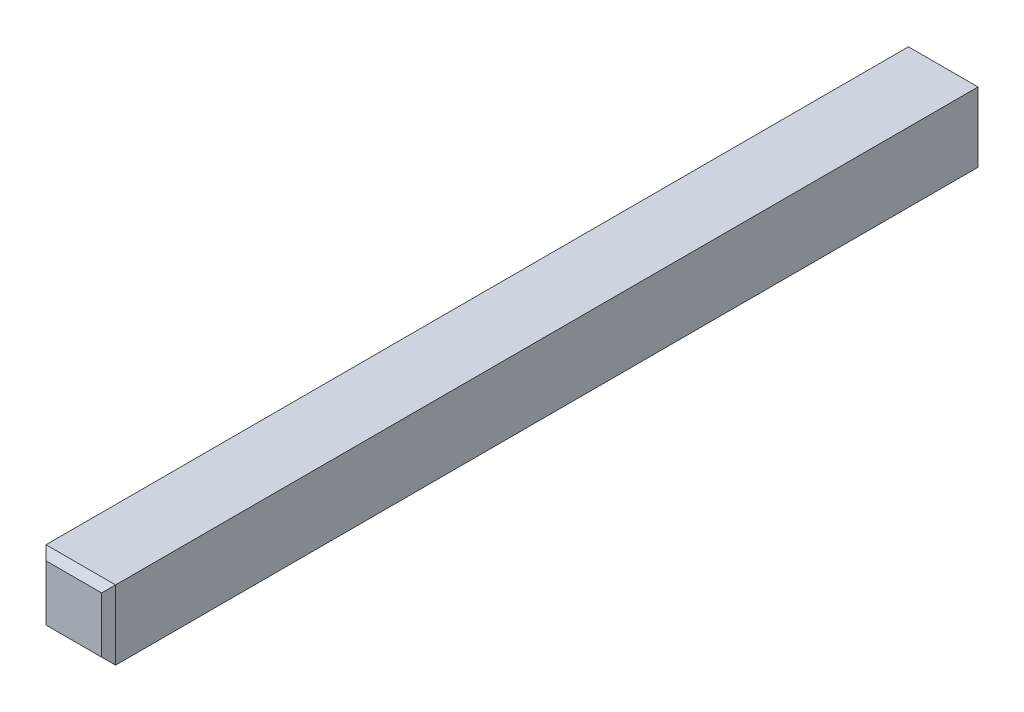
from build123d import *

# Parameters (mm, degrees)
SKETCH1_W           = 4
SKETCH1_H           = 4
BOSS_EXTRUDE1_DEPTH = 25
CHAMFER1_SIZE       = 0.4


with BuildPart() as part:
    # Sketch1 → Boss-Extrude1 (new, symmetric)
    with BuildSketch(Plane.XY):
        Rectangle(SKETCH1_W, SKETCH1_H)
    extrude(amount=BOSS_EXTRUDE1_DEPTH, both=True)

    # Chamfer1
    chamfer1_edges = [part.edges().sort_by_distance(p)[0] for p in [
        (-2, 0, 25),
        (0, -2, 25),
        (2, 0, 25),
        (0, 2, 25),
    ]]
    chamfer(chamfer1_edges, length=CHAMFER1_SIZE)


solid = part.part
